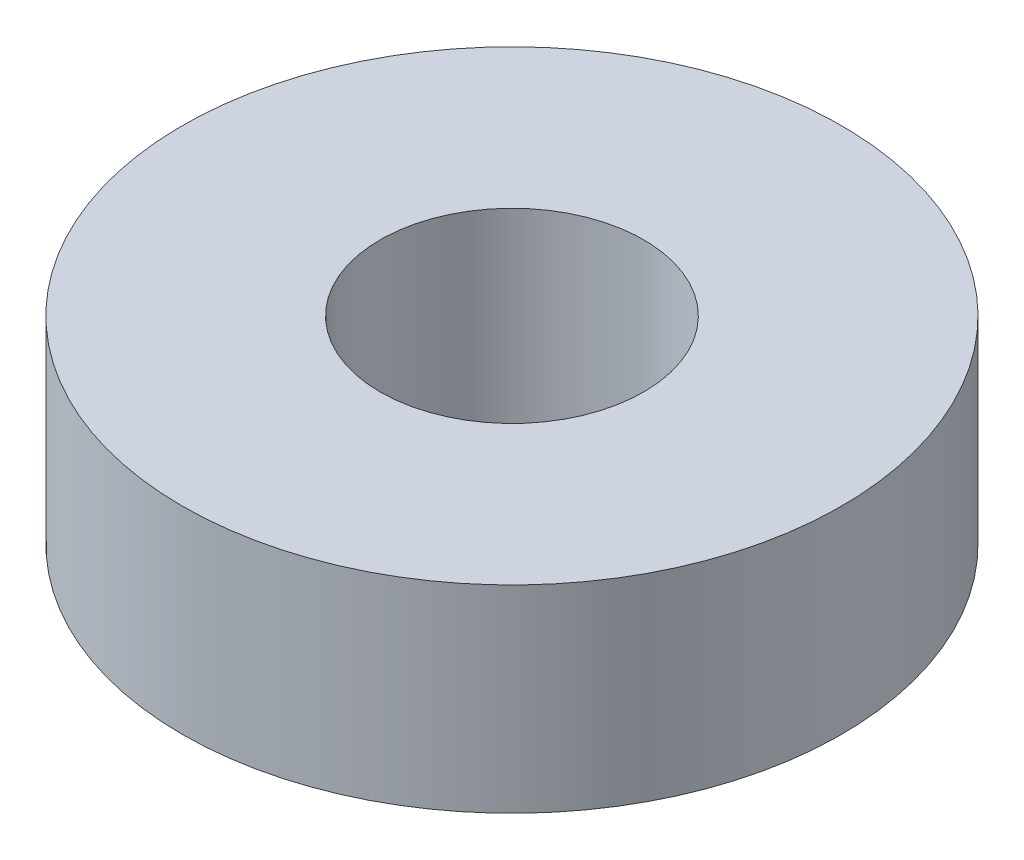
from build123d import *

# Parameters (mm, degrees)
SKETCH1_R      = 10
SKETCH1_R_2    = 4
EXTRUDE1_DEPTH = 6


with BuildPart() as part:
    # Sketch1 → Extrude1 (new body)
    with BuildSketch(Plane(origin=(0, 0, 0), x_dir=(1, 0, 0), z_dir=(0, 1, 0))):
        with Locations(Location((0, 0, 0), (0, 0, 270))):
            Circle(SKETCH1_R)
        with Locations(Location((0, 0, 0), (0, 0, 270))):
            Circle(SKETCH1_R_2, mode=Mode.SUBTRACT)
    extrude(amount=EXTRUDE1_DEPTH)


solid = part.part
